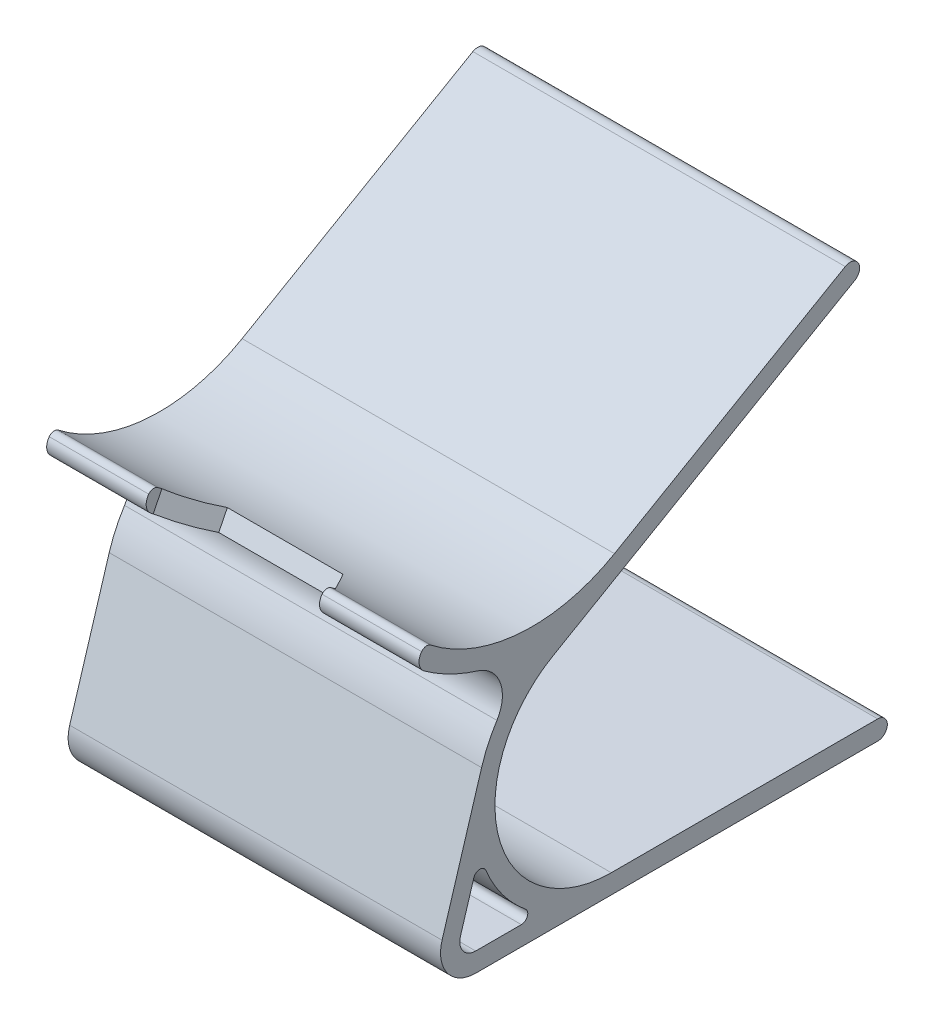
ISO-10303-21;
HEADER;
FILE_DESCRIPTION(('STEP AP214'),'2;1');
FILE_NAME('part.step','',(''),(''),'','','');
FILE_SCHEMA(('AUTOMOTIVE_DESIGN { 1 0 10303 214 1 1 1 1 }'));
ENDSEC;
DATA;
#1=APPLICATION_CONTEXT('core data for automotive mechanical design processes');
#2=APPLICATION_PROTOCOL_DEFINITION('international standard','automotive_design',2000,#1);
#3=PRODUCT_CONTEXT('',#1,'mechanical');
#4=PRODUCT('Part','Part','',(#3));
#5=PRODUCT_RELATED_PRODUCT_CATEGORY('part','',(#4));
#6=PRODUCT_DEFINITION_FORMATION('','',#4);
#7=PRODUCT_DEFINITION_CONTEXT('part definition',#1,'design');
#8=PRODUCT_DEFINITION('design','',#6,#7);
#9=PRODUCT_DEFINITION_SHAPE('','',#8);
#10=(LENGTH_UNIT() NAMED_UNIT(*) SI_UNIT(.MILLI.,.METRE.));
#11=(NAMED_UNIT(*) PLANE_ANGLE_UNIT() SI_UNIT($,.RADIAN.));
#12=(NAMED_UNIT(*) SI_UNIT($,.STERADIAN.) SOLID_ANGLE_UNIT());
#13=UNCERTAINTY_MEASURE_WITH_UNIT(LENGTH_MEASURE(1.E-05),#10,'distance_accuracy_value','');
#14=(GEOMETRIC_REPRESENTATION_CONTEXT(3) GLOBAL_UNCERTAINTY_ASSIGNED_CONTEXT((#13)) GLOBAL_UNIT_ASSIGNED_CONTEXT((#10,
#11,#12)) REPRESENTATION_CONTEXT('',''));
#15=CARTESIAN_POINT('',(0.,0.,0.));
#16=DIRECTION('',(0.,0.,1.));
#17=DIRECTION('',(1.,0.,0.));
#18=AXIS2_PLACEMENT_3D('',#15,#16,#17);
#19=CARTESIAN_POINT('',(58.,46.3883455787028,27.9443865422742));
#20=DIRECTION('',(-1.,0.,0.));
#21=DIRECTION('',(0.,0.,1.));
#22=AXIS2_PLACEMENT_3D('',#19,#20,#21);
#23=CYLINDRICAL_SURFACE('',#22,2.);
#24=CARTESIAN_POINT('',(15.5,46.3883455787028,27.9443865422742));
#25=DIRECTION('',(-1.,0.,0.));
#26=DIRECTION('',(0.,0.,1.));
#27=AXIS2_PLACEMENT_3D('',#24,#25,#26);
#28=CIRCLE('',#27,2.);
#29=CARTESIAN_POINT('',(15.5,47.5881255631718,29.5445515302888));
#30=VERTEX_POINT('',#29);
#31=CARTESIAN_POINT('',(15.5,44.7659796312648,29.1139713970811));
#32=VERTEX_POINT('',#31);
#33=EDGE_CURVE('E264',#30,#32,#28,.F.);
#34=ORIENTED_EDGE('',*,*,#33,.F.);
#35=DIRECTION('',(-1.,0.,0.));
#36=VECTOR('',#35,1.);
#37=CARTESIAN_POINT('',(58.,47.5881255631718,29.5445515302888));
#38=LINE('',#37,#36);
#39=CARTESIAN_POINT('',(0.,47.5881255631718,29.5445515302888));
#40=VERTEX_POINT('',#39);
#41=EDGE_CURVE('E472',#30,#40,#38,.T.);
#42=ORIENTED_EDGE('',*,*,#41,.T.);
#43=CARTESIAN_POINT('',(0.,46.3883455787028,27.9443865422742));
#44=DIRECTION('',(-1.,0.,0.));
#45=DIRECTION('',(0.,0.,1.));
#46=AXIS2_PLACEMENT_3D('',#43,#44,#45);
#47=CIRCLE('',#46,2.);
#48=CARTESIAN_POINT('',(0.,44.7659796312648,29.1139713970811));
#49=VERTEX_POINT('',#48);
#50=EDGE_CURVE('E465',#49,#40,#47,.T.);
#51=ORIENTED_EDGE('',*,*,#50,.F.);
#52=DIRECTION('',(-1.,0.,0.));
#53=VECTOR('',#52,1.);
#54=CARTESIAN_POINT('',(58.,44.7659796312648,29.1139713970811));
#55=LINE('',#54,#53);
#56=EDGE_CURVE('E460',#32,#49,#55,.T.);
#57=ORIENTED_EDGE('',*,*,#56,.F.);
#58=EDGE_LOOP('',(#34,#42,#51,#57));
#59=FACE_BOUND('',#58,.T.);
#60=ADVANCED_FACE('F39',(#59),#23,.T.);
#61=CARTESIAN_POINT('',(58.,46.9882355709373,28.7444690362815));
#62=DIRECTION('',(1.,0.,0.));
#63=DIRECTION('',(0.,0.,-1.));
#64=AXIS2_PLACEMENT_3D('',#61,#62,#63);
#65=CYLINDRICAL_SURFACE('',#64,1.);
#66=CARTESIAN_POINT('',(42.5,46.9882355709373,28.7444690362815));
#67=DIRECTION('',(1.,0.,0.));
#68=DIRECTION('',(0.,0.,-1.));
#69=AXIS2_PLACEMENT_3D('',#66,#67,#68);
#70=CIRCLE('',#69,1.);
#71=CARTESIAN_POINT('',(42.5,47.5881255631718,29.5445515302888));
#72=VERTEX_POINT('',#71);
#73=CARTESIAN_POINT('',(42.5,47.7769366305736,28.1296921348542));
#74=VERTEX_POINT('',#73);
#75=EDGE_CURVE('E532',#72,#74,#70,.F.);
#76=ORIENTED_EDGE('',*,*,#75,.F.);
#77=CARTESIAN_POINT('',(58.,47.5881255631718,29.5445515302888));
#78=VERTEX_POINT('',#77);
#79=EDGE_CURVE('E473',#78,#72,#38,.T.);
#80=ORIENTED_EDGE('',*,*,#79,.F.);
#81=CARTESIAN_POINT('',(58.,46.9882355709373,28.7444690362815));
#82=DIRECTION('',(-1.,0.,0.));
#83=DIRECTION('',(0.,0.,1.));
#84=AXIS2_PLACEMENT_3D('',#81,#82,#83);
#85=CIRCLE('',#84,1.);
#86=CARTESIAN_POINT('',(58.,47.7769366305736,28.1296921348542));
#87=VERTEX_POINT('',#86);
#88=EDGE_CURVE('E483',#87,#78,#85,.F.);
#89=ORIENTED_EDGE('',*,*,#88,.F.);
#90=DIRECTION('',(-1.,0.,0.));
#91=VECTOR('',#90,1.);
#92=CARTESIAN_POINT('',(58.,47.7769366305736,28.1296921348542));
#93=LINE('',#92,#91);
#94=EDGE_CURVE('E480',#74,#87,#93,.F.);
#95=ORIENTED_EDGE('',*,*,#94,.F.);
#96=EDGE_LOOP('',(#76,#80,#89,#95));
#97=FACE_BOUND('',#96,.T.);
#98=ADVANCED_FACE('F558',(#97),#65,.T.);
#99=CARTESIAN_POINT('',(58.,21.1173331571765,0.));
#100=DIRECTION('',(-1.,0.,0.));
#101=DIRECTION('',(0.,0.,1.));
#102=AXIS2_PLACEMENT_3D('',#99,#100,#101);
#103=PLANE('',#102);
#104=CARTESIAN_POINT('',(58.,1.5,-41.5));
#105=DIRECTION('',(-1.,0.,0.));
#106=DIRECTION('',(0.,0.,1.));
#107=AXIS2_PLACEMENT_3D('',#104,#105,#106);
#108=CIRCLE('',#107,1.5);
#109=CARTESIAN_POINT('',(58.,0.,-41.5));
#110=VERTEX_POINT('',#109);
#111=CARTESIAN_POINT('',(58.,1.5,-43.));
#112=VERTEX_POINT('',#111);
#113=EDGE_CURVE('E507',#110,#112,#108,.F.);
#114=ORIENTED_EDGE('',*,*,#113,.T.);
#115=CARTESIAN_POINT('',(58.,1.5,-41.5));
#116=DIRECTION('',(-1.,0.,0.));
#117=DIRECTION('',(0.,0.,1.));
#118=AXIS2_PLACEMENT_3D('',#115,#116,#117);
#119=CIRCLE('',#118,1.5);
#120=CARTESIAN_POINT('',(58.,3.,-41.5));
#121=VERTEX_POINT('',#120);
#122=EDGE_CURVE('E510',#112,#121,#119,.F.);
#123=ORIENTED_EDGE('',*,*,#122,.T.);
#124=DIRECTION('',(0.,0.,1.));
#125=VECTOR('',#124,1.);
#126=CARTESIAN_POINT('',(58.,3.,-43.));
#127=LINE('',#126,#125);
#128=CARTESIAN_POINT('',(58.,2.99999999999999,0.));
#129=VERTEX_POINT('',#128);
#130=EDGE_CURVE('E361',#121,#129,#127,.T.);
#131=ORIENTED_EDGE('',*,*,#130,.T.);
#132=CARTESIAN_POINT('',(58.,21.1173331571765,0.));
#133=DIRECTION('',(-1.,0.,0.));
#134=DIRECTION('',(0.,0.,1.));
#135=AXIS2_PLACEMENT_3D('',#132,#133,#134);
#136=CIRCLE('',#135,18.1173331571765);
#137=CARTESIAN_POINT('',(58.,36.8074039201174,9.05866657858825));
#138=VERTEX_POINT('',#137);
#139=EDGE_CURVE('E365',#129,#138,#136,.T.);
#140=ORIENTED_EDGE('',*,*,#139,.T.);
#141=DIRECTION('',(0.,0.500000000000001,-0.866025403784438));
#142=VECTOR('',#141,1.);
#143=CARTESIAN_POINT('',(58.,64.6929218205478,-39.2404672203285));
#144=LINE('',#143,#142);
#145=CARTESIAN_POINT('',(58.,63.9429218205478,-37.9414291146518));
#146=VERTEX_POINT('',#145);
#147=EDGE_CURVE('E368',#138,#146,#144,.T.);
#148=ORIENTED_EDGE('',*,*,#147,.T.);
#149=CARTESIAN_POINT('',(58.,65.2419599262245,-37.1914291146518));
#150=DIRECTION('',(-1.,0.,0.));
#151=DIRECTION('',(0.,0.,1.));
#152=AXIS2_PLACEMENT_3D('',#149,#150,#151);
#153=CIRCLE('',#152,1.5);
#154=CARTESIAN_POINT('',(58.,65.9919599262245,-38.4904672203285));
#155=VERTEX_POINT('',#154);
#156=EDGE_CURVE('E504',#146,#155,#153,.F.);
#157=ORIENTED_EDGE('',*,*,#156,.T.);
#158=CARTESIAN_POINT('',(58.,65.2419599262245,-37.1914291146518));
#159=DIRECTION('',(-1.,0.,0.));
#160=DIRECTION('',(0.,0.,1.));
#161=AXIS2_PLACEMENT_3D('',#158,#159,#160);
#162=CIRCLE('',#161,1.5);
#163=CARTESIAN_POINT('',(58.,66.5409980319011,-36.4414291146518));
#164=VERTEX_POINT('',#163);
#165=EDGE_CURVE('E63',#155,#164,#162,.F.);
#166=ORIENTED_EDGE('',*,*,#165,.T.);
#167=DIRECTION('',(0.,-0.500000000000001,0.866025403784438));
#168=VECTOR('',#167,1.);
#169=CARTESIAN_POINT('',(58.,67.2909980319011,-37.7404672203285));
#170=LINE('',#169,#168);
#171=CARTESIAN_POINT('',(58.,45.7909980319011,-0.50137485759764));
#172=VERTEX_POINT('',#171);
#173=EDGE_CURVE('E372',#164,#172,#170,.T.);
#174=ORIENTED_EDGE('',*,*,#173,.T.);
#175=CARTESIAN_POINT('',(58.,68.0333241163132,12.3402380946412));
#176=DIRECTION('',(-1.,0.,0.));
#177=DIRECTION('',(0.,0.,1.));
#178=AXIS2_PLACEMENT_3D('',#175,#176,#177);
#179=CIRCLE('',#178,25.6832259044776);
#180=EDGE_CURVE('E375',#172,#87,#179,.T.);
#181=ORIENTED_EDGE('',*,*,#180,.T.);
#182=ORIENTED_EDGE('',*,*,#88,.T.);
#183=CARTESIAN_POINT('',(58.,46.3883455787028,27.9443865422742));
#184=DIRECTION('',(-1.,0.,0.));
#185=DIRECTION('',(0.,0.,1.));
#186=AXIS2_PLACEMENT_3D('',#183,#184,#185);
#187=CIRCLE('',#186,2.);
#188=CARTESIAN_POINT('',(58.,44.7659796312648,29.1139713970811));
#189=VERTEX_POINT('',#188);
#190=EDGE_CURVE('E469',#78,#189,#187,.F.);
#191=ORIENTED_EDGE('',*,*,#190,.T.);
#192=CARTESIAN_POINT('',(58.,68.0333241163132,12.3402380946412));
#193=DIRECTION('',(1.,0.,0.));
#194=DIRECTION('',(0.,0.,-1.));
#195=AXIS2_PLACEMENT_3D('',#192,#193,#194);
#196=CIRCLE('',#195,28.6832259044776);
#197=CARTESIAN_POINT('',(58.,40.6310124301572,20.8161311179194));
#198=VERTEX_POINT('',#197);
#199=EDGE_CURVE('E379',#189,#198,#196,.T.);
#200=ORIENTED_EDGE('',*,*,#199,.T.);
#201=CARTESIAN_POINT('',(58.,35.3985061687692,22.4346136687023));
#202=DIRECTION('',(-1.,0.,0.));
#203=DIRECTION('',(0.,0.,1.));
#204=AXIS2_PLACEMENT_3D('',#201,#202,#203);
#205=CIRCLE('',#204,5.47709846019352);
#206=CARTESIAN_POINT('',(58.,32.4573118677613,17.8142258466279));
#207=VERTEX_POINT('',#206);
#208=EDGE_CURVE('E382',#198,#207,#205,.T.);
#209=ORIENTED_EDGE('',*,*,#208,.T.);
#210=CARTESIAN_POINT('',(58.,21.1173331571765,0.));
#211=DIRECTION('',(1.,0.,0.));
#212=DIRECTION('',(0.,0.,1.));
#213=AXIS2_PLACEMENT_3D('',#210,#211,#212);
#214=CIRCLE('',#213,21.1173331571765);
#215=CARTESIAN_POINT('',(58.,27.2738601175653,20.1999736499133));
#216=VERTEX_POINT('',#215);
#217=EDGE_CURVE('E385',#207,#216,#214,.T.);
#218=ORIENTED_EDGE('',*,*,#217,.T.);
#219=DIRECTION('',(0.,-0.95655893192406,0.291539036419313));
#220=VECTOR('',#219,1.);
#221=CARTESIAN_POINT('',(58.,7.07388646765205,26.3565006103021));
#222=LINE('',#221,#220);
#223=CARTESIAN_POINT('',(58.,7.07388646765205,26.3565006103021));
#224=VERTEX_POINT('',#223);
#225=EDGE_CURVE('E388',#216,#224,#222,.T.);
#226=ORIENTED_EDGE('',*,*,#225,.T.);
#227=CARTESIAN_POINT('',(58.,5.47709846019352,21.1173331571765));
#228=DIRECTION('',(1.,0.,0.));
#229=DIRECTION('',(0.,0.,1.));
#230=AXIS2_PLACEMENT_3D('',#227,#228,#229);
#231=CIRCLE('',#230,5.47709846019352);
#232=CARTESIAN_POINT('',(58.,0.,21.1173331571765));
#233=VERTEX_POINT('',#232);
#234=EDGE_CURVE('E391',#224,#233,#231,.T.);
#235=ORIENTED_EDGE('',*,*,#234,.T.);
#236=DIRECTION('',(0.,0.,-1.));
#237=VECTOR('',#236,1.);
#238=CARTESIAN_POINT('',(58.,0.,21.1173331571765));
#239=LINE('',#238,#237);
#240=EDGE_CURVE('E357',#233,#110,#239,.T.);
#241=ORIENTED_EDGE('',*,*,#240,.T.);
#242=EDGE_LOOP('',(#114,#123,#131,#140,#148,#157,#166,#174,#181,#182,#191,#200,#209,#218,#226,
#235,#241));
#243=FACE_BOUND('',#242,.T.);
#244=CARTESIAN_POINT('',(58.,5.47709846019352,21.1173331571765));
#245=DIRECTION('',(1.,0.,0.));
#246=DIRECTION('',(0.,0.,1.));
#247=AXIS2_PLACEMENT_3D('',#244,#245,#246);
#248=CIRCLE('',#247,2.47709846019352);
#249=CARTESIAN_POINT('',(58.,6.19926935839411,23.4868238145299));
#250=VERTEX_POINT('',#249);
#251=CARTESIAN_POINT('',(58.,3.,21.1173331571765));
#252=VERTEX_POINT('',#251);
#253=EDGE_CURVE('E292',#250,#252,#248,.T.);
#254=ORIENTED_EDGE('',*,*,#253,.F.);
#255=DIRECTION('',(0.,-0.95655893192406,0.291539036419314));
#256=VECTOR('',#255,1.);
#257=CARTESIAN_POINT('',(58.,13.00149777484,21.413647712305));
#258=LINE('',#257,#256);
#259=CARTESIAN_POINT('',(58.,13.00149777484,21.413647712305));
#260=VERTEX_POINT('',#259);
#261=EDGE_CURVE('E309',#260,#250,#258,.T.);
#262=ORIENTED_EDGE('',*,*,#261,.F.);
#263=CARTESIAN_POINT('',(58.,12.7099587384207,20.457088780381));
#264=DIRECTION('',(1.,0.,0.));
#265=DIRECTION('',(0.,0.,1.));
#266=AXIS2_PLACEMENT_3D('',#263,#264,#265);
#267=CIRCLE('',#266,0.999999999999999);
#268=CARTESIAN_POINT('',(58.,13.0900847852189,19.5321540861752));
#269=VERTEX_POINT('',#268);
#270=EDGE_CURVE('E305',#269,#260,#267,.T.);
#271=ORIENTED_EDGE('',*,*,#270,.F.);
#272=CARTESIAN_POINT('',(58.,21.1173331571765,0.));
#273=DIRECTION('',(-1.,0.,0.));
#274=DIRECTION('',(0.,0.,-1.));
#275=AXIS2_PLACEMENT_3D('',#272,#273,#274);
#276=CIRCLE('',#275,21.1173331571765);
#277=CARTESIAN_POINT('',(58.,4.77393296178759,13.3729215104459));
#278=VERTEX_POINT('',#277);
#279=EDGE_CURVE('E302',#278,#269,#276,.T.);
#280=ORIENTED_EDGE('',*,*,#279,.F.);
#281=CARTESIAN_POINT('',(58.,4.,14.0061890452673));
#282=DIRECTION('',(1.,0.,0.));
#283=DIRECTION('',(0.,0.,1.));
#284=AXIS2_PLACEMENT_3D('',#281,#282,#283);
#285=CIRCLE('',#284,1.);
#286=CARTESIAN_POINT('',(58.,3.,14.0061890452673));
#287=VERTEX_POINT('',#286);
#288=EDGE_CURVE('E299',#287,#278,#285,.T.);
#289=ORIENTED_EDGE('',*,*,#288,.F.);
#290=DIRECTION('',(0.,0.,-1.));
#291=VECTOR('',#290,1.);
#292=CARTESIAN_POINT('',(58.,3.,21.1173331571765));
#293=LINE('',#292,#291);
#294=EDGE_CURVE('E295',#252,#287,#293,.T.);
#295=ORIENTED_EDGE('',*,*,#294,.F.);
#296=EDGE_LOOP('',(#254,#262,#271,#280,#289,#295));
#297=FACE_BOUND('',#296,.T.);
#298=ADVANCED_FACE('F586',(#243,#297),#103,.F.);
#299=CARTESIAN_POINT('',(0.,21.1173331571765,0.));
#300=DIRECTION('',(-1.,0.,0.));
#301=DIRECTION('',(0.,0.,1.));
#302=AXIS2_PLACEMENT_3D('',#299,#300,#301);
#303=PLANE('',#302);
#304=DIRECTION('',(0.,0.,1.));
#305=VECTOR('',#304,1.);
#306=CARTESIAN_POINT('',(0.,3.,-43.));
#307=LINE('',#306,#305);
#308=CARTESIAN_POINT('',(0.,3.,-41.5));
#309=VERTEX_POINT('',#308);
#310=CARTESIAN_POINT('',(0.,2.99999999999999,0.));
#311=VERTEX_POINT('',#310);
#312=EDGE_CURVE('E398',#309,#311,#307,.T.);
#313=ORIENTED_EDGE('',*,*,#312,.F.);
#314=CARTESIAN_POINT('',(0.,1.5,-41.5));
#315=DIRECTION('',(-1.,0.,0.));
#316=DIRECTION('',(0.,0.,1.));
#317=AXIS2_PLACEMENT_3D('',#314,#315,#316);
#318=CIRCLE('',#317,1.5);
#319=CARTESIAN_POINT('',(0.,1.5,-43.));
#320=VERTEX_POINT('',#319);
#321=EDGE_CURVE('E499',#309,#320,#318,.T.);
#322=ORIENTED_EDGE('',*,*,#321,.T.);
#323=CARTESIAN_POINT('',(0.,1.5,-41.5));
#324=DIRECTION('',(-1.,0.,0.));
#325=DIRECTION('',(0.,0.,1.));
#326=AXIS2_PLACEMENT_3D('',#323,#324,#325);
#327=CIRCLE('',#326,1.5);
#328=CARTESIAN_POINT('',(0.,0.,-41.5));
#329=VERTEX_POINT('',#328);
#330=EDGE_CURVE('E496',#320,#329,#327,.T.);
#331=ORIENTED_EDGE('',*,*,#330,.T.);
#332=DIRECTION('',(0.,0.,-1.));
#333=VECTOR('',#332,1.);
#334=CARTESIAN_POINT('',(0.,0.,0.));
#335=LINE('',#334,#333);
#336=CARTESIAN_POINT('',(0.,0.,21.1173331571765));
#337=VERTEX_POINT('',#336);
#338=EDGE_CURVE('E356',#337,#329,#335,.T.);
#339=ORIENTED_EDGE('',*,*,#338,.F.);
#340=CARTESIAN_POINT('',(0.,5.47709846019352,21.1173331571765));
#341=DIRECTION('',(1.,0.,0.));
#342=DIRECTION('',(0.,0.,1.));
#343=AXIS2_PLACEMENT_3D('',#340,#341,#342);
#344=CIRCLE('',#343,5.47709846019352);
#345=CARTESIAN_POINT('',(0.,7.07388646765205,26.3565006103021));
#346=VERTEX_POINT('',#345);
#347=EDGE_CURVE('E362',#346,#337,#344,.T.);
#348=ORIENTED_EDGE('',*,*,#347,.F.);
#349=DIRECTION('',(0.,-0.95655893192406,0.291539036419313));
#350=VECTOR('',#349,1.);
#351=CARTESIAN_POINT('',(0.,7.07388646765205,26.3565006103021));
#352=LINE('',#351,#350);
#353=CARTESIAN_POINT('',(0.,27.2738601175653,20.1999736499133));
#354=VERTEX_POINT('',#353);
#355=EDGE_CURVE('E423',#354,#346,#352,.T.);
#356=ORIENTED_EDGE('',*,*,#355,.F.);
#357=CARTESIAN_POINT('',(0.,21.1173331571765,0.));
#358=DIRECTION('',(1.,0.,0.));
#359=DIRECTION('',(0.,0.,1.));
#360=AXIS2_PLACEMENT_3D('',#357,#358,#359);
#361=CIRCLE('',#360,21.1173331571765);
#362=CARTESIAN_POINT('',(0.,32.4573118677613,17.8142258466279));
#363=VERTEX_POINT('',#362);
#364=EDGE_CURVE('E420',#363,#354,#361,.T.);
#365=ORIENTED_EDGE('',*,*,#364,.F.);
#366=CARTESIAN_POINT('',(0.,35.3985061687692,22.4346136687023));
#367=DIRECTION('',(-1.,0.,0.));
#368=DIRECTION('',(0.,0.,1.));
#369=AXIS2_PLACEMENT_3D('',#366,#367,#368);
#370=CIRCLE('',#369,5.47709846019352);
#371=CARTESIAN_POINT('',(0.,40.6310124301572,20.8161311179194));
#372=VERTEX_POINT('',#371);
#373=EDGE_CURVE('E417',#372,#363,#370,.T.);
#374=ORIENTED_EDGE('',*,*,#373,.F.);
#375=CARTESIAN_POINT('',(0.,68.0333241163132,12.3402380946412));
#376=DIRECTION('',(1.,0.,0.));
#377=DIRECTION('',(0.,0.,-1.));
#378=AXIS2_PLACEMENT_3D('',#375,#376,#377);
#379=CIRCLE('',#378,28.6832259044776);
#380=EDGE_CURVE('E414',#49,#372,#379,.T.);
#381=ORIENTED_EDGE('',*,*,#380,.F.);
#382=ORIENTED_EDGE('',*,*,#50,.T.);
#383=CARTESIAN_POINT('',(0.,46.9882355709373,28.7444690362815));
#384=DIRECTION('',(-1.,0.,0.));
#385=DIRECTION('',(0.,0.,1.));
#386=AXIS2_PLACEMENT_3D('',#383,#384,#385);
#387=CIRCLE('',#386,1.);
#388=CARTESIAN_POINT('',(0.,47.7769366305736,28.1296921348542));
#389=VERTEX_POINT('',#388);
#390=EDGE_CURVE('E477',#40,#389,#387,.T.);
#391=ORIENTED_EDGE('',*,*,#390,.T.);
#392=CARTESIAN_POINT('',(0.,68.0333241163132,12.3402380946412));
#393=DIRECTION('',(-1.,0.,0.));
#394=DIRECTION('',(0.,0.,1.));
#395=AXIS2_PLACEMENT_3D('',#392,#393,#394);
#396=CIRCLE('',#395,25.6832259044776);
#397=CARTESIAN_POINT('',(0.,45.7909980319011,-0.50137485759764));
#398=VERTEX_POINT('',#397);
#399=EDGE_CURVE('E411',#398,#389,#396,.T.);
#400=ORIENTED_EDGE('',*,*,#399,.F.);
#401=DIRECTION('',(0.,-0.500000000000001,0.866025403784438));
#402=VECTOR('',#401,1.);
#403=CARTESIAN_POINT('',(0.,67.2909980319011,-37.7404672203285));
#404=LINE('',#403,#402);
#405=CARTESIAN_POINT('',(0.,66.5409980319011,-36.4414291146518));
#406=VERTEX_POINT('',#405);
#407=EDGE_CURVE('E408',#406,#398,#404,.T.);
#408=ORIENTED_EDGE('',*,*,#407,.F.);
#409=CARTESIAN_POINT('',(0.,65.2419599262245,-37.1914291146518));
#410=DIRECTION('',(-1.,0.,0.));
#411=DIRECTION('',(0.,0.,1.));
#412=AXIS2_PLACEMENT_3D('',#409,#410,#411);
#413=CIRCLE('',#412,1.5);
#414=CARTESIAN_POINT('',(0.,65.9919599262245,-38.4904672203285));
#415=VERTEX_POINT('',#414);
#416=EDGE_CURVE('E490',#406,#415,#413,.T.);
#417=ORIENTED_EDGE('',*,*,#416,.T.);
#418=CARTESIAN_POINT('',(0.,65.2419599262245,-37.1914291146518));
#419=DIRECTION('',(-1.,0.,0.));
#420=DIRECTION('',(0.,0.,1.));
#421=AXIS2_PLACEMENT_3D('',#418,#419,#420);
#422=CIRCLE('',#421,1.5);
#423=CARTESIAN_POINT('',(0.,63.9429218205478,-37.9414291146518));
#424=VERTEX_POINT('',#423);
#425=EDGE_CURVE('E493',#415,#424,#422,.T.);
#426=ORIENTED_EDGE('',*,*,#425,.T.);
#427=DIRECTION('',(0.,0.500000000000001,-0.866025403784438));
#428=VECTOR('',#427,1.);
#429=CARTESIAN_POINT('',(0.,64.6929218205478,-39.2404672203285));
#430=LINE('',#429,#428);
#431=CARTESIAN_POINT('',(0.,36.8074039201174,9.05866657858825));
#432=VERTEX_POINT('',#431);
#433=EDGE_CURVE('E404',#432,#424,#430,.T.);
#434=ORIENTED_EDGE('',*,*,#433,.F.);
#435=CARTESIAN_POINT('',(0.,21.1173331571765,0.));
#436=DIRECTION('',(-1.,0.,0.));
#437=DIRECTION('',(0.,0.,1.));
#438=AXIS2_PLACEMENT_3D('',#435,#436,#437);
#439=CIRCLE('',#438,18.1173331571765);
#440=EDGE_CURVE('E401',#311,#432,#439,.T.);
#441=ORIENTED_EDGE('',*,*,#440,.F.);
#442=EDGE_LOOP('',(#313,#322,#331,#339,#348,#356,#365,#374,#381,#382,#391,#400,#408,#417,#426,
#434,#441));
#443=FACE_BOUND('',#442,.T.);
#444=DIRECTION('',(0.,-0.95655893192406,0.291539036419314));
#445=VECTOR('',#444,1.);
#446=CARTESIAN_POINT('',(0.,13.00149777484,21.413647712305));
#447=LINE('',#446,#445);
#448=CARTESIAN_POINT('',(0.,13.00149777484,21.413647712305));
#449=VERTEX_POINT('',#448);
#450=CARTESIAN_POINT('',(0.,6.19926935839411,23.4868238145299));
#451=VERTEX_POINT('',#450);
#452=EDGE_CURVE('E296',#449,#451,#447,.T.);
#453=ORIENTED_EDGE('',*,*,#452,.T.);
#454=CARTESIAN_POINT('',(0.,5.47709846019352,21.1173331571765));
#455=DIRECTION('',(1.,0.,0.));
#456=DIRECTION('',(0.,0.,1.));
#457=AXIS2_PLACEMENT_3D('',#454,#455,#456);
#458=CIRCLE('',#457,2.47709846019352);
#459=CARTESIAN_POINT('',(0.,3.,21.1173331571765));
#460=VERTEX_POINT('',#459);
#461=EDGE_CURVE('E313',#451,#460,#458,.T.);
#462=ORIENTED_EDGE('',*,*,#461,.T.);
#463=DIRECTION('',(0.,0.,-1.));
#464=VECTOR('',#463,1.);
#465=CARTESIAN_POINT('',(0.,3.,21.1173331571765));
#466=LINE('',#465,#464);
#467=CARTESIAN_POINT('',(0.,3.,14.0061890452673));
#468=VERTEX_POINT('',#467);
#469=EDGE_CURVE('E317',#460,#468,#466,.T.);
#470=ORIENTED_EDGE('',*,*,#469,.T.);
#471=CARTESIAN_POINT('',(0.,4.,14.0061890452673));
#472=DIRECTION('',(1.,0.,0.));
#473=DIRECTION('',(0.,0.,1.));
#474=AXIS2_PLACEMENT_3D('',#471,#472,#473);
#475=CIRCLE('',#474,1.);
#476=CARTESIAN_POINT('',(0.,4.77393296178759,13.3729215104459));
#477=VERTEX_POINT('',#476);
#478=EDGE_CURVE('E322',#468,#477,#475,.T.);
#479=ORIENTED_EDGE('',*,*,#478,.T.);
#480=CARTESIAN_POINT('',(0.,21.1173331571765,0.));
#481=DIRECTION('',(-1.,0.,0.));
#482=DIRECTION('',(0.,0.,-1.));
#483=AXIS2_PLACEMENT_3D('',#480,#481,#482);
#484=CIRCLE('',#483,21.1173331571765);
#485=CARTESIAN_POINT('',(0.,13.0900847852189,19.5321540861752));
#486=VERTEX_POINT('',#485);
#487=EDGE_CURVE('E326',#477,#486,#484,.T.);
#488=ORIENTED_EDGE('',*,*,#487,.T.);
#489=CARTESIAN_POINT('',(0.,12.7099587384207,20.457088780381));
#490=DIRECTION('',(1.,0.,0.));
#491=DIRECTION('',(0.,0.,1.));
#492=AXIS2_PLACEMENT_3D('',#489,#490,#491);
#493=CIRCLE('',#492,0.999999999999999);
#494=EDGE_CURVE('E330',#486,#449,#493,.T.);
#495=ORIENTED_EDGE('',*,*,#494,.T.);
#496=EDGE_LOOP('',(#453,#462,#470,#479,#488,#495));
#497=FACE_BOUND('',#496,.T.);
#498=ADVANCED_FACE('F573',(#443,#497),#303,.T.);
#499=CARTESIAN_POINT('',(58.,0.,0.));
#500=DIRECTION('',(0.,1.,0.));
#501=DIRECTION('',(0.,0.,1.));
#502=AXIS2_PLACEMENT_3D('',#499,#500,#501);
#503=PLANE('',#502);
#504=ORIENTED_EDGE('',*,*,#338,.T.);
#505=DIRECTION('',(-1.,0.,0.));
#506=VECTOR('',#505,1.);
#507=CARTESIAN_POINT('',(58.,0.,-41.5));
#508=LINE('',#507,#506);
#509=EDGE_CURVE('E513',#329,#110,#508,.F.);
#510=ORIENTED_EDGE('',*,*,#509,.T.);
#511=ORIENTED_EDGE('',*,*,#240,.F.);
#512=DIRECTION('',(-1.,0.,0.));
#513=VECTOR('',#512,1.);
#514=CARTESIAN_POINT('',(58.,0.,21.1173331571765));
#515=LINE('',#514,#513);
#516=EDGE_CURVE('E394',#233,#337,#515,.T.);
#517=ORIENTED_EDGE('',*,*,#516,.T.);
#518=EDGE_LOOP('',(#504,#510,#511,#517));
#519=FACE_BOUND('',#518,.T.);
#520=ADVANCED_FACE('F651',(#519),#503,.F.);
#521=CARTESIAN_POINT('',(58.,3.,-43.));
#522=DIRECTION('',(0.,-1.,0.));
#523=DIRECTION('',(0.,0.,-1.));
#524=AXIS2_PLACEMENT_3D('',#521,#522,#523);
#525=PLANE('',#524);
#526=ORIENTED_EDGE('',*,*,#130,.F.);
#527=DIRECTION('',(-1.,0.,0.));
#528=VECTOR('',#527,1.);
#529=CARTESIAN_POINT('',(58.,3.,-41.5));
#530=LINE('',#529,#528);
#531=EDGE_CURVE('E486',#121,#309,#530,.T.);
#532=ORIENTED_EDGE('',*,*,#531,.T.);
#533=ORIENTED_EDGE('',*,*,#312,.T.);
#534=DIRECTION('',(-1.,0.,0.));
#535=VECTOR('',#534,1.);
#536=CARTESIAN_POINT('',(58.,2.99999999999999,0.));
#537=LINE('',#536,#535);
#538=EDGE_CURVE('E456',#129,#311,#537,.T.);
#539=ORIENTED_EDGE('',*,*,#538,.F.);
#540=EDGE_LOOP('',(#526,#532,#533,#539));
#541=FACE_BOUND('',#540,.T.);
#542=ADVANCED_FACE('F678',(#541),#525,.F.);
#543=CARTESIAN_POINT('',(58.,21.1173331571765,0.));
#544=DIRECTION('',(-1.,0.,0.));
#545=DIRECTION('',(0.,0.,1.));
#546=AXIS2_PLACEMENT_3D('',#543,#544,#545);
#547=CYLINDRICAL_SURFACE('',#546,18.1173331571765);
#548=ORIENTED_EDGE('',*,*,#440,.T.);
#549=DIRECTION('',(-1.,0.,0.));
#550=VECTOR('',#549,1.);
#551=CARTESIAN_POINT('',(58.,36.8074039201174,9.05866657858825));
#552=LINE('',#551,#550);
#553=EDGE_CURVE('E452',#138,#432,#552,.T.);
#554=ORIENTED_EDGE('',*,*,#553,.F.);
#555=ORIENTED_EDGE('',*,*,#139,.F.);
#556=ORIENTED_EDGE('',*,*,#538,.T.);
#557=EDGE_LOOP('',(#548,#554,#555,#556));
#558=FACE_BOUND('',#557,.T.);
#559=ADVANCED_FACE('F674',(#558),#547,.F.);
#560=CARTESIAN_POINT('',(58.,64.6929218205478,-39.2404672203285));
#561=DIRECTION('',(0.,0.866025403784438,0.500000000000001));
#562=DIRECTION('',(0.,-0.500000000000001,0.866025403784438));
#563=AXIS2_PLACEMENT_3D('',#560,#561,#562);
#564=PLANE('',#563);
#565=ORIENTED_EDGE('',*,*,#433,.T.);
#566=DIRECTION('',(-1.,0.,0.));
#567=VECTOR('',#566,1.);
#568=CARTESIAN_POINT('',(58.,63.9429218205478,-37.9414291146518));
#569=LINE('',#568,#567);
#570=EDGE_CURVE('E516',#424,#146,#569,.F.);
#571=ORIENTED_EDGE('',*,*,#570,.T.);
#572=ORIENTED_EDGE('',*,*,#147,.F.);
#573=ORIENTED_EDGE('',*,*,#553,.T.);
#574=EDGE_LOOP('',(#565,#571,#572,#573));
#575=FACE_BOUND('',#574,.T.);
#576=ADVANCED_FACE('F670',(#575),#564,.F.);
#577=CARTESIAN_POINT('',(58.,67.2909980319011,-37.7404672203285));
#578=DIRECTION('',(0.,-0.866025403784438,-0.500000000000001));
#579=DIRECTION('',(0.,0.500000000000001,-0.866025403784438));
#580=AXIS2_PLACEMENT_3D('',#577,#578,#579);
#581=PLANE('',#580);
#582=ORIENTED_EDGE('',*,*,#173,.F.);
#583=DIRECTION('',(-1.,0.,0.));
#584=VECTOR('',#583,1.);
#585=CARTESIAN_POINT('',(58.,66.5409980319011,-36.4414291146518));
#586=LINE('',#585,#584);
#587=EDGE_CURVE('E520',#164,#406,#586,.T.);
#588=ORIENTED_EDGE('',*,*,#587,.T.);
#589=ORIENTED_EDGE('',*,*,#407,.T.);
#590=DIRECTION('',(-1.,0.,0.));
#591=VECTOR('',#590,1.);
#592=CARTESIAN_POINT('',(58.,45.7909980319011,-0.50137485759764));
#593=LINE('',#592,#591);
#594=EDGE_CURVE('E448',#172,#398,#593,.T.);
#595=ORIENTED_EDGE('',*,*,#594,.F.);
#596=EDGE_LOOP('',(#582,#588,#589,#595));
#597=FACE_BOUND('',#596,.T.);
#598=ADVANCED_FACE('F667',(#597),#581,.F.);
#599=CARTESIAN_POINT('',(58.,68.0333241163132,12.3402380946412));
#600=DIRECTION('',(-1.,0.,0.));
#601=DIRECTION('',(0.,0.,1.));
#602=AXIS2_PLACEMENT_3D('',#599,#600,#601);
#603=CYLINDRICAL_SURFACE('',#602,25.6832259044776);
#604=CARTESIAN_POINT('',(39.514564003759,68.0333241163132,12.3402380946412));
#605=DIRECTION('',(0.822192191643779,-0.253872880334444,-0.509459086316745));
#606=DIRECTION('',(-0.569209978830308,-0.366705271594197,-0.735885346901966));
#607=AXIS2_PLACEMENT_3D('',#604,#605,#606);
#608=ELLIPSE('',#607,31.2374967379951,25.6832259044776);
#609=CARTESIAN_POINT('',(38.,44.1539178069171,21.7955036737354));
#610=VERTEX_POINT('',#609);
#611=CARTESIAN_POINT('',(42.5,47.2957702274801,27.4922000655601));
#612=VERTEX_POINT('',#611);
#613=EDGE_CURVE('E288',#610,#612,#608,.F.);
#614=ORIENTED_EDGE('',*,*,#613,.T.);
#615=CARTESIAN_POINT('',(42.5,68.0333241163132,12.3402380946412));
#616=DIRECTION('',(1.,0.,0.));
#617=DIRECTION('',(0.,0.,-1.));
#618=AXIS2_PLACEMENT_3D('',#615,#616,#617);
#619=CIRCLE('',#618,25.6832259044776);
#620=EDGE_CURVE('E250',#612,#74,#619,.F.);
#621=ORIENTED_EDGE('',*,*,#620,.T.);
#622=ORIENTED_EDGE('',*,*,#94,.T.);
#623=ORIENTED_EDGE('',*,*,#180,.F.);
#624=ORIENTED_EDGE('',*,*,#594,.T.);
#625=ORIENTED_EDGE('',*,*,#399,.T.);
#626=CARTESIAN_POINT('',(15.5,47.7769366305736,28.1296921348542));
#627=VERTEX_POINT('',#626);
#628=EDGE_CURVE('E262',#389,#627,#93,.F.);
#629=ORIENTED_EDGE('',*,*,#628,.T.);
#630=CARTESIAN_POINT('',(15.5,68.0333241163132,12.3402380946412));
#631=DIRECTION('',(-1.,0.,0.));
#632=DIRECTION('',(0.,0.,1.));
#633=AXIS2_PLACEMENT_3D('',#630,#631,#632);
#634=CIRCLE('',#633,25.6832259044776);
#635=CARTESIAN_POINT('',(15.5,47.2957702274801,27.4922000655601));
#636=VERTEX_POINT('',#635);
#637=EDGE_CURVE('E55',#627,#636,#634,.F.);
#638=ORIENTED_EDGE('',*,*,#637,.T.);
#639=CARTESIAN_POINT('',(18.485435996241,68.0333241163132,12.3402380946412));
#640=DIRECTION('',(-0.822192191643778,-0.253872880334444,-0.509459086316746));
#641=DIRECTION('',(-0.569209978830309,0.366705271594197,0.735885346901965));
#642=AXIS2_PLACEMENT_3D('',#639,#640,#641);
#643=ELLIPSE('',#642,31.2374967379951,25.6832259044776);
#644=CARTESIAN_POINT('',(20.,44.1539178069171,21.7955036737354));
#645=VERTEX_POINT('',#644);
#646=EDGE_CURVE('E240',#636,#645,#643,.F.);
#647=ORIENTED_EDGE('',*,*,#646,.T.);
#648=DIRECTION('',(-1.,0.,0.));
#649=VECTOR('',#648,1.);
#650=CARTESIAN_POINT('',(58.,44.1539178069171,21.7955036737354));
#651=LINE('',#650,#649);
#652=EDGE_CURVE('E249',#645,#610,#651,.F.);
#653=ORIENTED_EDGE('',*,*,#652,.T.);
#654=EDGE_LOOP('',(#614,#621,#622,#623,#624,#625,#629,#638,#647,#653));
#655=FACE_BOUND('',#654,.T.);
#656=ADVANCED_FACE('F259',(#655),#603,.F.);
#657=CARTESIAN_POINT('',(58.,68.0333241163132,12.3402380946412));
#658=DIRECTION('',(-1.,0.,0.));
#659=DIRECTION('',(0.,0.,1.));
#660=AXIS2_PLACEMENT_3D('',#657,#658,#659);
#661=CYLINDRICAL_SURFACE('',#660,28.6832259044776);
#662=CARTESIAN_POINT('',(42.5,44.7659796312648,29.1139713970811));
#663=VERTEX_POINT('',#662);
#664=EDGE_CURVE('E461',#189,#663,#55,.T.);
#665=ORIENTED_EDGE('',*,*,#664,.T.);
#666=CARTESIAN_POINT('',(42.5,68.0333241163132,12.3402380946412));
#667=DIRECTION('',(1.,0.,0.));
#668=DIRECTION('',(0.,0.,-1.));
#669=AXIS2_PLACEMENT_3D('',#666,#667,#668);
#670=CIRCLE('',#669,28.6832259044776);
#671=CARTESIAN_POINT('',(42.5,44.5761371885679,28.8474434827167));
#672=VERTEX_POINT('',#671);
#673=EDGE_CURVE('E279',#663,#672,#670,.T.);
#674=ORIENTED_EDGE('',*,*,#673,.T.);
#675=CARTESIAN_POINT('',(39.514564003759,68.0333241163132,12.3402380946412));
#676=DIRECTION('',(0.822192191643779,-0.253872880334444,-0.509459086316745));
#677=DIRECTION('',(-0.569209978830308,-0.366705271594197,-0.735885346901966));
#678=AXIS2_PLACEMENT_3D('',#675,#676,#677);
#679=ELLIPSE('',#678,34.886278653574,28.6832259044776);
#680=CARTESIAN_POINT('',(38.,41.4600675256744,23.1378990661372));
#681=VERTEX_POINT('',#680);
#682=EDGE_CURVE('E11',#672,#681,#679,.T.);
#683=ORIENTED_EDGE('',*,*,#682,.T.);
#684=DIRECTION('',(-1.,0.,0.));
#685=VECTOR('',#684,1.);
#686=CARTESIAN_POINT('',(58.,41.4600675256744,23.1378990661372));
#687=LINE('',#686,#685);
#688=CARTESIAN_POINT('',(20.,41.4600675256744,23.1378990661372));
#689=VERTEX_POINT('',#688);
#690=EDGE_CURVE('E48',#681,#689,#687,.T.);
#691=ORIENTED_EDGE('',*,*,#690,.T.);
#692=CARTESIAN_POINT('',(18.485435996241,68.0333241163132,12.3402380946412));
#693=DIRECTION('',(-0.822192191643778,-0.253872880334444,-0.509459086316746));
#694=DIRECTION('',(-0.569209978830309,0.366705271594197,0.735885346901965));
#695=AXIS2_PLACEMENT_3D('',#692,#693,#694);
#696=ELLIPSE('',#695,34.886278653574,28.6832259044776);
#697=CARTESIAN_POINT('',(15.5,44.5761371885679,28.8474434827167));
#698=VERTEX_POINT('',#697);
#699=EDGE_CURVE('E535',#689,#698,#696,.T.);
#700=ORIENTED_EDGE('',*,*,#699,.T.);
#701=CARTESIAN_POINT('',(15.5,68.0333241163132,12.3402380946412));
#702=DIRECTION('',(-1.,0.,0.));
#703=DIRECTION('',(0.,0.,1.));
#704=AXIS2_PLACEMENT_3D('',#701,#702,#703);
#705=CIRCLE('',#704,28.6832259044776);
#706=EDGE_CURVE('E254',#698,#32,#705,.T.);
#707=ORIENTED_EDGE('',*,*,#706,.T.);
#708=ORIENTED_EDGE('',*,*,#56,.T.);
#709=ORIENTED_EDGE('',*,*,#380,.T.);
#710=DIRECTION('',(-1.,0.,0.));
#711=VECTOR('',#710,1.);
#712=CARTESIAN_POINT('',(58.,40.6310124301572,20.8161311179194));
#713=LINE('',#712,#711);
#714=EDGE_CURVE('E444',#198,#372,#713,.T.);
#715=ORIENTED_EDGE('',*,*,#714,.F.);
#716=ORIENTED_EDGE('',*,*,#199,.F.);
#717=EDGE_LOOP('',(#665,#674,#683,#691,#700,#707,#708,#709,#715,#716));
#718=FACE_BOUND('',#717,.T.);
#719=ADVANCED_FACE('F540',(#718),#661,.T.);
#720=CARTESIAN_POINT('',(58.,35.3985061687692,22.4346136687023));
#721=DIRECTION('',(-1.,0.,0.));
#722=DIRECTION('',(0.,0.,1.));
#723=AXIS2_PLACEMENT_3D('',#720,#721,#722);
#724=CYLINDRICAL_SURFACE('',#723,5.47709846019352);
#725=ORIENTED_EDGE('',*,*,#373,.T.);
#726=DIRECTION('',(-1.,0.,0.));
#727=VECTOR('',#726,1.);
#728=CARTESIAN_POINT('',(58.,32.4573118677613,17.8142258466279));
#729=LINE('',#728,#727);
#730=EDGE_CURVE('E440',#207,#363,#729,.T.);
#731=ORIENTED_EDGE('',*,*,#730,.F.);
#732=ORIENTED_EDGE('',*,*,#208,.F.);
#733=ORIENTED_EDGE('',*,*,#714,.T.);
#734=EDGE_LOOP('',(#725,#731,#732,#733));
#735=FACE_BOUND('',#734,.T.);
#736=ADVANCED_FACE('F579',(#735),#724,.F.);
#737=CARTESIAN_POINT('',(58.,21.1173331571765,0.));
#738=DIRECTION('',(-1.,0.,0.));
#739=DIRECTION('',(0.,0.,1.));
#740=AXIS2_PLACEMENT_3D('',#737,#738,#739);
#741=CYLINDRICAL_SURFACE('',#740,21.1173331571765);
#742=ORIENTED_EDGE('',*,*,#364,.T.);
#743=DIRECTION('',(-1.,0.,0.));
#744=VECTOR('',#743,1.);
#745=CARTESIAN_POINT('',(58.,27.2738601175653,20.1999736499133));
#746=LINE('',#745,#744);
#747=EDGE_CURVE('E436',#216,#354,#746,.T.);
#748=ORIENTED_EDGE('',*,*,#747,.F.);
#749=ORIENTED_EDGE('',*,*,#217,.F.);
#750=ORIENTED_EDGE('',*,*,#730,.T.);
#751=EDGE_LOOP('',(#742,#748,#749,#750));
#752=FACE_BOUND('',#751,.T.);
#753=ADVANCED_FACE('F583',(#752),#741,.T.);
#754=CARTESIAN_POINT('',(58.,7.07388646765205,26.3565006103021));
#755=DIRECTION('',(0.,-0.291539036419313,-0.95655893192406));
#756=DIRECTION('',(0.,0.95655893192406,-0.291539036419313));
#757=AXIS2_PLACEMENT_3D('',#754,#755,#756);
#758=PLANE('',#757);
#759=ORIENTED_EDGE('',*,*,#355,.T.);
#760=DIRECTION('',(-1.,0.,0.));
#761=VECTOR('',#760,1.);
#762=CARTESIAN_POINT('',(58.,7.07388646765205,26.3565006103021));
#763=LINE('',#762,#761);
#764=EDGE_CURVE('E432',#224,#346,#763,.T.);
#765=ORIENTED_EDGE('',*,*,#764,.F.);
#766=ORIENTED_EDGE('',*,*,#225,.F.);
#767=ORIENTED_EDGE('',*,*,#747,.T.);
#768=EDGE_LOOP('',(#759,#765,#766,#767));
#769=FACE_BOUND('',#768,.T.);
#770=ADVANCED_FACE('F654',(#769),#758,.F.);
#771=CARTESIAN_POINT('',(58.,5.47709846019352,21.1173331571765));
#772=DIRECTION('',(-1.,0.,0.));
#773=DIRECTION('',(0.,0.,1.));
#774=AXIS2_PLACEMENT_3D('',#771,#772,#773);
#775=CYLINDRICAL_SURFACE('',#774,5.47709846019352);
#776=ORIENTED_EDGE('',*,*,#347,.T.);
#777=ORIENTED_EDGE('',*,*,#516,.F.);
#778=ORIENTED_EDGE('',*,*,#234,.F.);
#779=ORIENTED_EDGE('',*,*,#764,.T.);
#780=EDGE_LOOP('',(#776,#777,#778,#779));
#781=FACE_BOUND('',#780,.T.);
#782=ADVANCED_FACE('F645',(#781),#775,.T.);
#783=CARTESIAN_POINT('',(58.,5.47709846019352,21.1173331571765));
#784=DIRECTION('',(-1.,0.,0.));
#785=DIRECTION('',(0.,0.,1.));
#786=AXIS2_PLACEMENT_3D('',#783,#784,#785);
#787=CYLINDRICAL_SURFACE('',#786,2.47709846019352);
#788=ORIENTED_EDGE('',*,*,#461,.F.);
#789=DIRECTION('',(-1.,0.,0.));
#790=VECTOR('',#789,1.);
#791=CARTESIAN_POINT('',(58.,6.19926935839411,23.4868238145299));
#792=LINE('',#791,#790);
#793=EDGE_CURVE('E312',#250,#451,#792,.T.);
#794=ORIENTED_EDGE('',*,*,#793,.F.);
#795=ORIENTED_EDGE('',*,*,#253,.T.);
#796=DIRECTION('',(-1.,0.,0.));
#797=VECTOR('',#796,1.);
#798=CARTESIAN_POINT('',(58.,3.,21.1173331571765));
#799=LINE('',#798,#797);
#800=EDGE_CURVE('E352',#252,#460,#799,.T.);
#801=ORIENTED_EDGE('',*,*,#800,.T.);
#802=EDGE_LOOP('',(#788,#794,#795,#801));
#803=FACE_BOUND('',#802,.T.);
#804=ADVANCED_FACE('F641',(#803),#787,.F.);
#805=CARTESIAN_POINT('',(58.,3.,21.1173331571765));
#806=DIRECTION('',(0.,1.,0.));
#807=DIRECTION('',(0.,0.,1.));
#808=AXIS2_PLACEMENT_3D('',#805,#806,#807);
#809=PLANE('',#808);
#810=ORIENTED_EDGE('',*,*,#469,.F.);
#811=ORIENTED_EDGE('',*,*,#800,.F.);
#812=ORIENTED_EDGE('',*,*,#294,.T.);
#813=DIRECTION('',(-1.,0.,0.));
#814=VECTOR('',#813,1.);
#815=CARTESIAN_POINT('',(58.,3.,14.0061890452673));
#816=LINE('',#815,#814);
#817=EDGE_CURVE('E349',#287,#468,#816,.T.);
#818=ORIENTED_EDGE('',*,*,#817,.T.);
#819=EDGE_LOOP('',(#810,#811,#812,#818));
#820=FACE_BOUND('',#819,.T.);
#821=ADVANCED_FACE('F637',(#820),#809,.T.);
#822=CARTESIAN_POINT('',(58.,4.,14.0061890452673));
#823=DIRECTION('',(-1.,0.,0.));
#824=DIRECTION('',(0.,0.,1.));
#825=AXIS2_PLACEMENT_3D('',#822,#823,#824);
#826=CYLINDRICAL_SURFACE('',#825,1.);
#827=ORIENTED_EDGE('',*,*,#478,.F.);
#828=ORIENTED_EDGE('',*,*,#817,.F.);
#829=ORIENTED_EDGE('',*,*,#288,.T.);
#830=DIRECTION('',(-1.,0.,0.));
#831=VECTOR('',#830,1.);
#832=CARTESIAN_POINT('',(58.,4.77393296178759,13.3729215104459));
#833=LINE('',#832,#831);
#834=EDGE_CURVE('E346',#278,#477,#833,.T.);
#835=ORIENTED_EDGE('',*,*,#834,.T.);
#836=EDGE_LOOP('',(#827,#828,#829,#835));
#837=FACE_BOUND('',#836,.T.);
#838=ADVANCED_FACE('F633',(#837),#826,.F.);
#839=CARTESIAN_POINT('',(58.,21.1173331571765,0.));
#840=DIRECTION('',(-1.,0.,0.));
#841=DIRECTION('',(0.,0.,1.));
#842=AXIS2_PLACEMENT_3D('',#839,#840,#841);
#843=CYLINDRICAL_SURFACE('',#842,21.1173331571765);
#844=ORIENTED_EDGE('',*,*,#487,.F.);
#845=ORIENTED_EDGE('',*,*,#834,.F.);
#846=ORIENTED_EDGE('',*,*,#279,.T.);
#847=DIRECTION('',(-1.,0.,0.));
#848=VECTOR('',#847,1.);
#849=CARTESIAN_POINT('',(58.,13.0900847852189,19.5321540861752));
#850=LINE('',#849,#848);
#851=EDGE_CURVE('E343',#269,#486,#850,.T.);
#852=ORIENTED_EDGE('',*,*,#851,.T.);
#853=EDGE_LOOP('',(#844,#845,#846,#852));
#854=FACE_BOUND('',#853,.T.);
#855=ADVANCED_FACE('F626',(#854),#843,.T.);
#856=CARTESIAN_POINT('',(58.,12.7099587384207,20.457088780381));
#857=DIRECTION('',(-1.,0.,0.));
#858=DIRECTION('',(0.,0.,1.));
#859=AXIS2_PLACEMENT_3D('',#856,#857,#858);
#860=CYLINDRICAL_SURFACE('',#859,0.999999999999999);
#861=ORIENTED_EDGE('',*,*,#494,.F.);
#862=ORIENTED_EDGE('',*,*,#851,.F.);
#863=ORIENTED_EDGE('',*,*,#270,.T.);
#864=DIRECTION('',(-1.,0.,0.));
#865=VECTOR('',#864,1.);
#866=CARTESIAN_POINT('',(58.,13.00149777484,21.413647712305));
#867=LINE('',#866,#865);
#868=EDGE_CURVE('E340',#260,#449,#867,.T.);
#869=ORIENTED_EDGE('',*,*,#868,.T.);
#870=EDGE_LOOP('',(#861,#862,#863,#869));
#871=FACE_BOUND('',#870,.T.);
#872=ADVANCED_FACE('F621',(#871),#860,.F.);
#873=CARTESIAN_POINT('',(58.,13.00149777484,21.413647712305));
#874=DIRECTION('',(0.,-0.291539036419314,-0.95655893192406));
#875=DIRECTION('',(0.,0.95655893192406,-0.291539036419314));
#876=AXIS2_PLACEMENT_3D('',#873,#874,#875);
#877=PLANE('',#876);
#878=ORIENTED_EDGE('',*,*,#452,.F.);
#879=ORIENTED_EDGE('',*,*,#868,.F.);
#880=ORIENTED_EDGE('',*,*,#261,.T.);
#881=ORIENTED_EDGE('',*,*,#793,.T.);
#882=EDGE_LOOP('',(#878,#879,#880,#881));
#883=FACE_BOUND('',#882,.T.);
#884=ADVANCED_FACE('F614',(#883),#877,.T.);
#885=CARTESIAN_POINT('',(42.5,46.3883455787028,27.9443865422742));
#886=DIRECTION('',(1.,0.,0.));
#887=DIRECTION('',(0.,0.,-1.));
#888=AXIS2_PLACEMENT_3D('',#885,#886,#887);
#889=CIRCLE('',#888,2.);
#890=EDGE_CURVE('E276',#663,#72,#889,.F.);
#891=ORIENTED_EDGE('',*,*,#890,.F.);
#892=ORIENTED_EDGE('',*,*,#664,.F.);
#893=ORIENTED_EDGE('',*,*,#190,.F.);
#894=ORIENTED_EDGE('',*,*,#79,.T.);
#895=EDGE_LOOP('',(#891,#892,#893,#894));
#896=FACE_BOUND('',#895,.T.);
#897=ADVANCED_FACE('F593',(#896),#23,.T.);
#898=CARTESIAN_POINT('',(15.5,46.9882355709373,28.7444690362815));
#899=DIRECTION('',(-1.,0.,0.));
#900=DIRECTION('',(0.,0.,1.));
#901=AXIS2_PLACEMENT_3D('',#898,#899,#900);
#902=CIRCLE('',#901,1.);
#903=EDGE_CURVE('E523',#627,#30,#902,.F.);
#904=ORIENTED_EDGE('',*,*,#903,.F.);
#905=ORIENTED_EDGE('',*,*,#628,.F.);
#906=ORIENTED_EDGE('',*,*,#390,.F.);
#907=ORIENTED_EDGE('',*,*,#41,.F.);
#908=EDGE_LOOP('',(#904,#905,#906,#907));
#909=FACE_BOUND('',#908,.T.);
#910=ADVANCED_FACE('F611',(#909),#65,.T.);
#911=CARTESIAN_POINT('',(58.,1.5,-41.5));
#912=DIRECTION('',(-1.,0.,0.));
#913=DIRECTION('',(0.,0.,1.));
#914=AXIS2_PLACEMENT_3D('',#911,#912,#913);
#915=CYLINDRICAL_SURFACE('',#914,1.5);
#916=DIRECTION('',(-1.,0.,0.));
#917=VECTOR('',#916,1.);
#918=CARTESIAN_POINT('',(58.,1.5,-43.));
#919=LINE('',#918,#917);
#920=EDGE_CURVE('E318',#112,#320,#919,.T.);
#921=ORIENTED_EDGE('',*,*,#920,.F.);
#922=ORIENTED_EDGE('',*,*,#113,.F.);
#923=ORIENTED_EDGE('',*,*,#509,.F.);
#924=ORIENTED_EDGE('',*,*,#330,.F.);
#925=EDGE_LOOP('',(#921,#922,#923,#924));
#926=FACE_BOUND('',#925,.T.);
#927=ADVANCED_FACE('F619',(#926),#915,.T.);
#928=CARTESIAN_POINT('',(58.,1.5,-41.5));
#929=DIRECTION('',(-1.,0.,0.));
#930=DIRECTION('',(0.,0.,1.));
#931=AXIS2_PLACEMENT_3D('',#928,#929,#930);
#932=CYLINDRICAL_SURFACE('',#931,1.5);
#933=ORIENTED_EDGE('',*,*,#122,.F.);
#934=ORIENTED_EDGE('',*,*,#920,.T.);
#935=ORIENTED_EDGE('',*,*,#321,.F.);
#936=ORIENTED_EDGE('',*,*,#531,.F.);
#937=EDGE_LOOP('',(#933,#934,#935,#936));
#938=FACE_BOUND('',#937,.T.);
#939=ADVANCED_FACE('F701',(#938),#932,.T.);
#940=CARTESIAN_POINT('',(58.,65.2419599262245,-37.1914291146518));
#941=DIRECTION('',(-1.,0.,0.));
#942=DIRECTION('',(0.,0.,1.));
#943=AXIS2_PLACEMENT_3D('',#940,#941,#942);
#944=CYLINDRICAL_SURFACE('',#943,1.5);
#945=ORIENTED_EDGE('',*,*,#587,.F.);
#946=ORIENTED_EDGE('',*,*,#165,.F.);
#947=DIRECTION('',(-1.,0.,0.));
#948=VECTOR('',#947,1.);
#949=CARTESIAN_POINT('',(58.,65.9919599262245,-38.4904672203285));
#950=LINE('',#949,#948);
#951=EDGE_CURVE('E291',#415,#155,#950,.F.);
#952=ORIENTED_EDGE('',*,*,#951,.F.);
#953=ORIENTED_EDGE('',*,*,#416,.F.);
#954=EDGE_LOOP('',(#945,#946,#952,#953));
#955=FACE_BOUND('',#954,.T.);
#956=ADVANCED_FACE('F41',(#955),#944,.T.);
#957=CARTESIAN_POINT('',(58.,65.2419599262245,-37.1914291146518));
#958=DIRECTION('',(-1.,0.,0.));
#959=DIRECTION('',(0.,0.,1.));
#960=AXIS2_PLACEMENT_3D('',#957,#958,#959);
#961=CYLINDRICAL_SURFACE('',#960,1.5);
#962=ORIENTED_EDGE('',*,*,#156,.F.);
#963=ORIENTED_EDGE('',*,*,#570,.F.);
#964=ORIENTED_EDGE('',*,*,#425,.F.);
#965=ORIENTED_EDGE('',*,*,#951,.T.);
#966=EDGE_LOOP('',(#962,#963,#964,#965));
#967=FACE_BOUND('',#966,.T.);
#968=ADVANCED_FACE('F709',(#967),#961,.T.);
#969=CARTESIAN_POINT('',(38.,88.1144260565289,-0.110830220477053));
#970=DIRECTION('',(0.822192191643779,-0.253872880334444,-0.509459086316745));
#971=DIRECTION('',(-0.526715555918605,0.,-0.850041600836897));
#972=AXIS2_PLACEMENT_3D('',#969,#970,#971);
#973=PLANE('',#972);
#974=DIRECTION('',(0.,-0.895028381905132,0.446009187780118));
#975=VECTOR('',#974,1.);
#976=CARTESIAN_POINT('',(38.,88.1144260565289,-0.110830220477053));
#977=LINE('',#976,#975);
#978=EDGE_CURVE('E271',#610,#681,#977,.T.);
#979=ORIENTED_EDGE('',*,*,#978,.T.);
#980=ORIENTED_EDGE('',*,*,#682,.F.);
#981=DIRECTION('',(0.,-0.895028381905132,0.446009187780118));
#982=VECTOR('',#981,1.);
#983=CARTESIAN_POINT('',(42.5,91.0134857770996,5.70685426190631));
#984=LINE('',#983,#982);
#985=EDGE_CURVE('E265',#612,#672,#984,.T.);
#986=ORIENTED_EDGE('',*,*,#985,.F.);
#987=ORIENTED_EDGE('',*,*,#613,.F.);
#988=EDGE_LOOP('',(#979,#980,#986,#987));
#989=FACE_BOUND('',#988,.T.);
#990=ADVANCED_FACE('F546',(#989),#973,.F.);
#991=CARTESIAN_POINT('',(20.,88.1144260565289,-0.110830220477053));
#992=DIRECTION('',(0.,-0.446009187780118,-0.895028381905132));
#993=DIRECTION('',(0.,0.895028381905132,-0.446009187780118));
#994=AXIS2_PLACEMENT_3D('',#991,#992,#993);
#995=PLANE('',#994);
#996=DIRECTION('',(0.,-0.895028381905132,0.446009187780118));
#997=VECTOR('',#996,1.);
#998=CARTESIAN_POINT('',(20.,88.1144260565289,-0.110830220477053));
#999=LINE('',#998,#997);
#1000=EDGE_CURVE('E245',#645,#689,#999,.T.);
#1001=ORIENTED_EDGE('',*,*,#1000,.T.);
#1002=ORIENTED_EDGE('',*,*,#690,.F.);
#1003=ORIENTED_EDGE('',*,*,#978,.F.);
#1004=ORIENTED_EDGE('',*,*,#652,.F.);
#1005=EDGE_LOOP('',(#1001,#1002,#1003,#1004));
#1006=FACE_BOUND('',#1005,.T.);
#1007=ADVANCED_FACE('F544',(#1006),#995,.F.);
#1008=CARTESIAN_POINT('',(15.5,91.0134857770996,5.70685426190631));
#1009=DIRECTION('',(-0.822192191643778,-0.253872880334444,-0.509459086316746));
#1010=DIRECTION('',(-0.526715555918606,0.,0.850041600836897));
#1011=AXIS2_PLACEMENT_3D('',#1008,#1009,#1010);
#1012=PLANE('',#1011);
#1013=DIRECTION('',(0.,-0.895028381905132,0.446009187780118));
#1014=VECTOR('',#1013,1.);
#1015=CARTESIAN_POINT('',(15.5,91.0134857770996,5.70685426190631));
#1016=LINE('',#1015,#1014);
#1017=EDGE_CURVE('E242',#636,#698,#1016,.T.);
#1018=ORIENTED_EDGE('',*,*,#1017,.T.);
#1019=ORIENTED_EDGE('',*,*,#699,.F.);
#1020=ORIENTED_EDGE('',*,*,#1000,.F.);
#1021=ORIENTED_EDGE('',*,*,#646,.F.);
#1022=EDGE_LOOP('',(#1018,#1019,#1020,#1021));
#1023=FACE_BOUND('',#1022,.T.);
#1024=ADVANCED_FACE('F241',(#1023),#1012,.F.);
#1025=CARTESIAN_POINT('',(42.5,91.0134857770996,5.70685426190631));
#1026=DIRECTION('',(1.,0.,0.));
#1027=DIRECTION('',(0.,0.,-1.));
#1028=AXIS2_PLACEMENT_3D('',#1025,#1026,#1027);
#1029=PLANE('',#1028);
#1030=ORIENTED_EDGE('',*,*,#985,.T.);
#1031=ORIENTED_EDGE('',*,*,#673,.F.);
#1032=ORIENTED_EDGE('',*,*,#890,.T.);
#1033=ORIENTED_EDGE('',*,*,#75,.T.);
#1034=ORIENTED_EDGE('',*,*,#620,.F.);
#1035=EDGE_LOOP('',(#1030,#1031,#1032,#1033,#1034));
#1036=FACE_BOUND('',#1035,.T.);
#1037=ADVANCED_FACE('F595',(#1036),#1029,.F.);
#1038=CARTESIAN_POINT('',(15.5,91.9055041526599,7.49691102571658));
#1039=DIRECTION('',(-1.,0.,0.));
#1040=DIRECTION('',(0.,0.,1.));
#1041=AXIS2_PLACEMENT_3D('',#1038,#1039,#1040);
#1042=PLANE('',#1041);
#1043=ORIENTED_EDGE('',*,*,#1017,.F.);
#1044=ORIENTED_EDGE('',*,*,#637,.F.);
#1045=ORIENTED_EDGE('',*,*,#903,.T.);
#1046=ORIENTED_EDGE('',*,*,#33,.T.);
#1047=ORIENTED_EDGE('',*,*,#706,.F.);
#1048=EDGE_LOOP('',(#1043,#1044,#1045,#1046,#1047));
#1049=FACE_BOUND('',#1048,.T.);
#1050=ADVANCED_FACE('F252',(#1049),#1042,.F.);
#1051=CLOSED_SHELL('',(#60,#98,#298,#498,#520,#542,#559,#576,#598,#656,#719,#736,#753,#770,#782,
#804,#821,#838,#855,#872,#884,#897,#910,#927,#939,#956,#968,#990,#1007,#1024,#1037,#1050));
#1052=MANIFOLD_SOLID_BREP('B2',#1051);
#1053=ADVANCED_BREP_SHAPE_REPRESENTATION('',(#18,#1052),#14);
#1054=SHAPE_DEFINITION_REPRESENTATION(#9,#1053);
ENDSEC;
END-ISO-10303-21;
